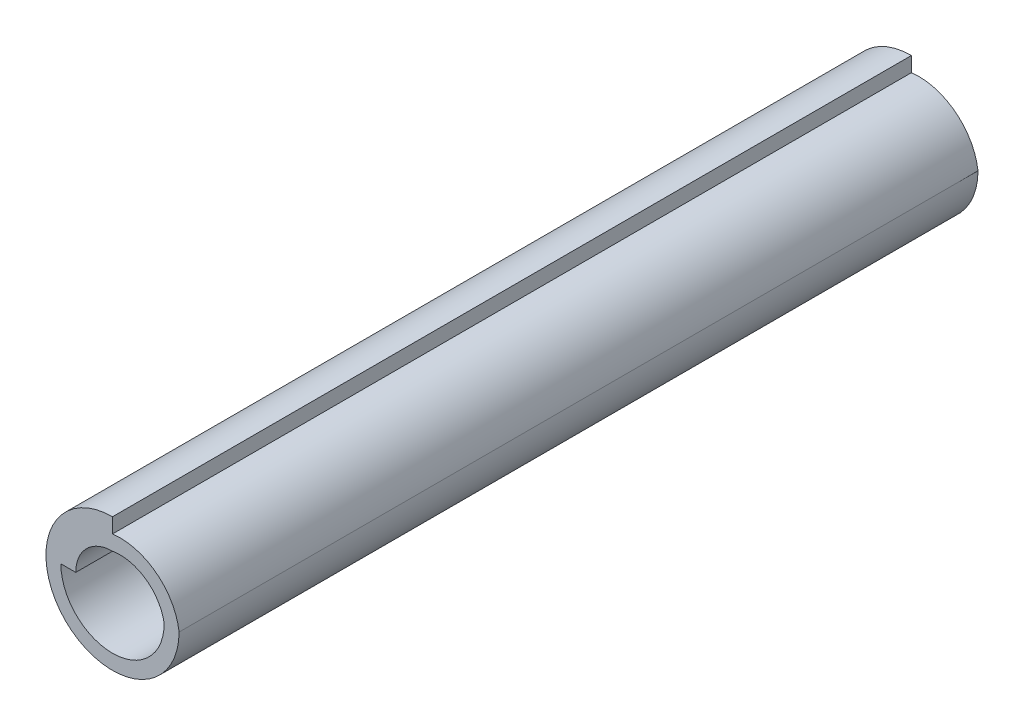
from build123d import *

# Parameters (mm, degrees)
BASE_EXTRUDE_DEPTH = 15


with BuildPart() as part:
    # Sketch1 → Base-Extrude (new, symmetric)
    with BuildSketch(Plane.XY):
        with BuildLine():
            Line((0, 1.94), (0, 2.5))
            ThreePointArc((0, 2.5), (-1.767766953, -1.767766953), (2.5, 0))
            ThreePointArc((2.5, 0), (1.651787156, 1.487766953), (0, 1.94))
        make_face()
        with BuildLine():
            Line((-1.94, 0), (-1.38, 0))
            ThreePointArc((-1.38, 0), (-0.975807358, 0.975807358), (0, 1.38))
            ThreePointArc((0, 1.38), (1.255807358, 1.091787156), (1.94, 0))
            ThreePointArc((1.94, 0), (0, -1.94), (-1.94, 0))
        make_face(mode=Mode.SUBTRACT)
    extrude(amount=BASE_EXTRUDE_DEPTH, both=True)


solid = part.part
